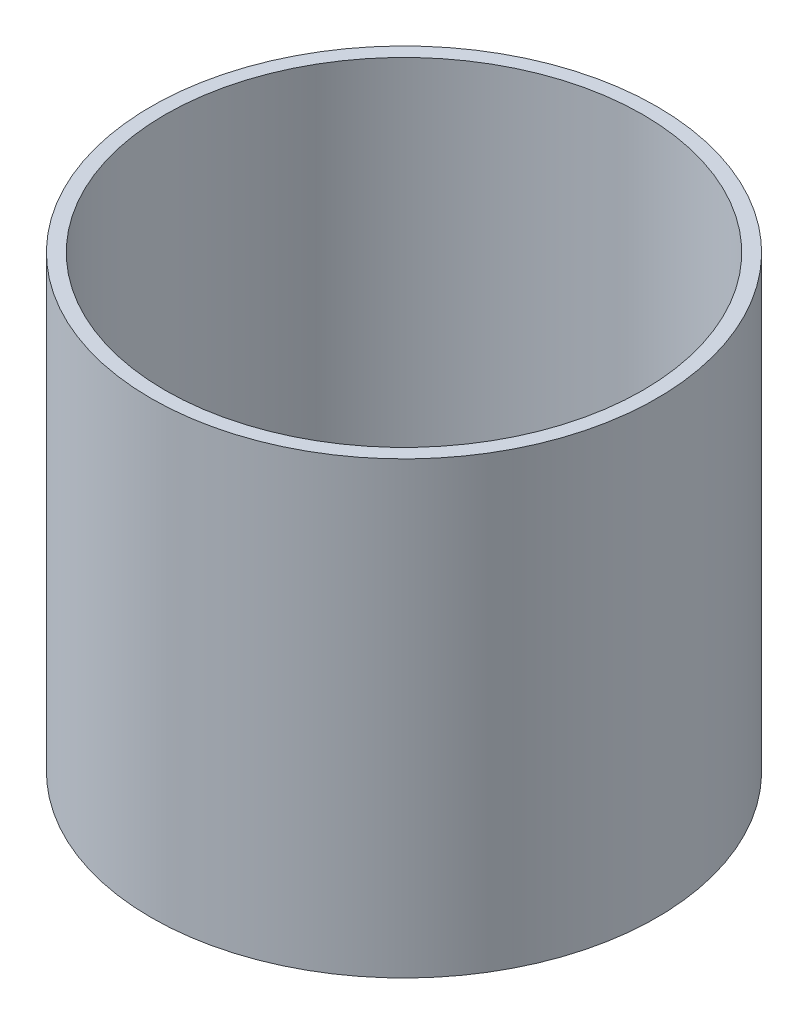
from build123d import *

# Parameters (mm, degrees)
SKETCH1_R           = 90
SKETCH1_R_2         = 85
BOSS_EXTRUDE1_DEPTH = 160


with BuildPart() as part:
    # Sketch1 → Boss-Extrude1 (new body)
    with BuildSketch(Plane(origin=(0, 0, 0), x_dir=(1, 0, 0), z_dir=(0, 1, 0))):
        with Locations(Location((0, 0, 0), (0, 0, 270))):
            Circle(SKETCH1_R)
        with Locations(Location((0, 0, 0), (0, 0, 270))):
            Circle(SKETCH1_R_2, mode=Mode.SUBTRACT)
    extrude(amount=BOSS_EXTRUDE1_DEPTH)


solid = part.part
